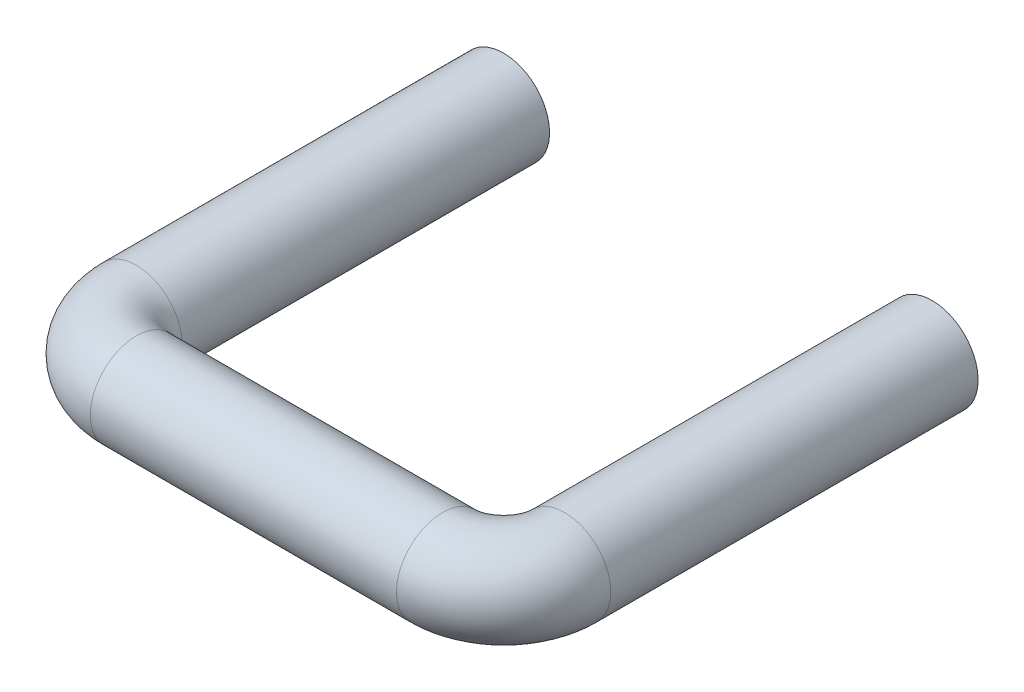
ISO-10303-21;
HEADER;
FILE_DESCRIPTION(('STEP AP214'),'2;1');
FILE_NAME('part.step','',(''),(''),'','','');
FILE_SCHEMA(('AUTOMOTIVE_DESIGN { 1 0 10303 214 1 1 1 1 }'));
ENDSEC;
DATA;
#1=APPLICATION_CONTEXT('core data for automotive mechanical design processes');
#2=APPLICATION_PROTOCOL_DEFINITION('international standard','automotive_design',2000,#1);
#3=PRODUCT_CONTEXT('',#1,'mechanical');
#4=PRODUCT('Part','Part','',(#3));
#5=PRODUCT_RELATED_PRODUCT_CATEGORY('part','',(#4));
#6=PRODUCT_DEFINITION_FORMATION('','',#4);
#7=PRODUCT_DEFINITION_CONTEXT('part definition',#1,'design');
#8=PRODUCT_DEFINITION('design','',#6,#7);
#9=PRODUCT_DEFINITION_SHAPE('','',#8);
#10=(LENGTH_UNIT() NAMED_UNIT(*) SI_UNIT(.MILLI.,.METRE.));
#11=(NAMED_UNIT(*) PLANE_ANGLE_UNIT() SI_UNIT($,.RADIAN.));
#12=(NAMED_UNIT(*) SI_UNIT($,.STERADIAN.) SOLID_ANGLE_UNIT());
#13=UNCERTAINTY_MEASURE_WITH_UNIT(LENGTH_MEASURE(1.E-05),#10,'distance_accuracy_value','');
#14=(GEOMETRIC_REPRESENTATION_CONTEXT(3) GLOBAL_UNCERTAINTY_ASSIGNED_CONTEXT((#13)) GLOBAL_UNIT_ASSIGNED_CONTEXT((#10,
#11,#12)) REPRESENTATION_CONTEXT('',''));
#15=CARTESIAN_POINT('',(0.,0.,0.));
#16=DIRECTION('',(0.,0.,1.));
#17=DIRECTION('',(1.,0.,0.));
#18=AXIS2_PLACEMENT_3D('',#15,#16,#17);
#19=CARTESIAN_POINT('',(70.,0.,60.));
#20=DIRECTION('',(0.,0.,-1.));
#21=DIRECTION('',(-1.,0.,0.));
#22=AXIS2_PLACEMENT_3D('',#19,#20,#21);
#23=CYLINDRICAL_SURFACE('',#22,7.5);
#24=CARTESIAN_POINT('',(70.,0.,60.));
#25=DIRECTION('',(0.,0.,-1.));
#26=DIRECTION('',(-1.,0.,0.));
#27=AXIS2_PLACEMENT_3D('',#24,#25,#26);
#28=CIRCLE('',#27,7.5);
#29=CARTESIAN_POINT('',(77.5,0.,60.));
#30=VERTEX_POINT('',#29);
#31=EDGE_CURVE('E37',#30,#30,#28,.T.);
#32=ORIENTED_EDGE('',*,*,#31,.T.);
#33=EDGE_LOOP('',(#32));
#34=FACE_BOUND('',#33,.T.);
#35=CARTESIAN_POINT('',(70.,0.,0.));
#36=DIRECTION('',(0.,0.,-1.));
#37=DIRECTION('',(-1.,0.,0.));
#38=AXIS2_PLACEMENT_3D('',#35,#36,#37);
#39=CIRCLE('',#38,7.5);
#40=CARTESIAN_POINT('',(62.5,0.,0.));
#41=VERTEX_POINT('',#40);
#42=EDGE_CURVE('E10',#41,#41,#39,.T.);
#43=ORIENTED_EDGE('',*,*,#42,.F.);
#44=EDGE_LOOP('',(#43));
#45=FACE_BOUND('',#44,.T.);
#46=ADVANCED_FACE('F31',(#34,#45),#23,.T.);
#47=CARTESIAN_POINT('',(60.,0.,60.));
#48=DIRECTION('',(0.,1.,0.));
#49=DIRECTION('',(0.,0.,1.));
#50=AXIS2_PLACEMENT_3D('',#47,#48,#49);
#51=TOROIDAL_SURFACE('',#50,10.,7.5);
#52=CARTESIAN_POINT('',(60.,0.,70.));
#53=DIRECTION('',(1.,0.,0.));
#54=DIRECTION('',(0.,0.,-1.));
#55=AXIS2_PLACEMENT_3D('',#52,#53,#54);
#56=CIRCLE('',#55,7.5);
#57=CARTESIAN_POINT('',(60.,0.,77.5));
#58=VERTEX_POINT('',#57);
#59=EDGE_CURVE('E41',#58,#58,#56,.T.);
#60=CARTESIAN_POINT('',(60.,0.,60.));
#61=DIRECTION('',(0.,1.,0.));
#62=DIRECTION('',(0.,0.,1.));
#63=AXIS2_PLACEMENT_3D('',#60,#61,#62);
#64=CIRCLE('',#63,17.5);
#65=EDGE_CURVE('',#58,#30,#64,.T.);
#66=ORIENTED_EDGE('',*,*,#59,.T.);
#67=ORIENTED_EDGE('',*,*,#31,.F.);
#68=ORIENTED_EDGE('',*,*,#65,.T.);
#69=ORIENTED_EDGE('',*,*,#65,.F.);
#70=EDGE_LOOP('',(#66,#68,#67,#69));
#71=FACE_BOUND('',#70,.T.);
#72=ADVANCED_FACE('F68',(#71),#51,.T.);
#73=CARTESIAN_POINT('',(10.,0.,70.));
#74=DIRECTION('',(1.,0.,0.));
#75=DIRECTION('',(0.,0.,-1.));
#76=AXIS2_PLACEMENT_3D('',#73,#74,#75);
#77=CYLINDRICAL_SURFACE('',#76,7.5);
#78=CARTESIAN_POINT('',(10.,0.,70.));
#79=DIRECTION('',(1.,0.,0.));
#80=DIRECTION('',(0.,0.,-1.));
#81=AXIS2_PLACEMENT_3D('',#78,#79,#80);
#82=CIRCLE('',#81,7.5);
#83=CARTESIAN_POINT('',(10.,0.,77.5));
#84=VERTEX_POINT('',#83);
#85=EDGE_CURVE('E45',#84,#84,#82,.T.);
#86=ORIENTED_EDGE('',*,*,#85,.T.);
#87=EDGE_LOOP('',(#86));
#88=FACE_BOUND('',#87,.T.);
#89=ORIENTED_EDGE('',*,*,#59,.F.);
#90=EDGE_LOOP('',(#89));
#91=FACE_BOUND('',#90,.T.);
#92=ADVANCED_FACE('F72',(#88,#91),#77,.T.);
#93=CARTESIAN_POINT('',(10.,0.,60.));
#94=DIRECTION('',(0.,1.,0.));
#95=DIRECTION('',(0.,0.,1.));
#96=AXIS2_PLACEMENT_3D('',#93,#94,#95);
#97=TOROIDAL_SURFACE('',#96,10.,7.5);
#98=CARTESIAN_POINT('',(0.,0.,60.));
#99=DIRECTION('',(0.,0.,1.));
#100=DIRECTION('',(1.,0.,0.));
#101=AXIS2_PLACEMENT_3D('',#98,#99,#100);
#102=CIRCLE('',#101,7.5);
#103=CARTESIAN_POINT('',(-7.49999999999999,0.,60.));
#104=VERTEX_POINT('',#103);
#105=EDGE_CURVE('E50',#104,#104,#102,.T.);
#106=CARTESIAN_POINT('',(10.,0.,60.));
#107=DIRECTION('',(0.,1.,0.));
#108=DIRECTION('',(0.,0.,1.));
#109=AXIS2_PLACEMENT_3D('',#106,#107,#108);
#110=CIRCLE('',#109,17.5);
#111=EDGE_CURVE('',#104,#84,#110,.T.);
#112=ORIENTED_EDGE('',*,*,#105,.T.);
#113=ORIENTED_EDGE('',*,*,#85,.F.);
#114=ORIENTED_EDGE('',*,*,#111,.T.);
#115=ORIENTED_EDGE('',*,*,#111,.F.);
#116=EDGE_LOOP('',(#112,#114,#113,#115));
#117=FACE_BOUND('',#116,.T.);
#118=ADVANCED_FACE('F78',(#117),#97,.T.);
#119=CARTESIAN_POINT('',(0.,0.,60.));
#120=DIRECTION('',(0.,0.,-1.));
#121=DIRECTION('',(-1.,0.,0.));
#122=AXIS2_PLACEMENT_3D('',#119,#120,#121);
#123=CYLINDRICAL_SURFACE('',#122,7.5);
#124=CARTESIAN_POINT('',(0.,0.,0.));
#125=DIRECTION('',(0.,0.,1.));
#126=DIRECTION('',(1.,0.,0.));
#127=AXIS2_PLACEMENT_3D('',#124,#125,#126);
#128=CIRCLE('',#127,7.5);
#129=CARTESIAN_POINT('',(-7.5,0.,0.));
#130=VERTEX_POINT('',#129);
#131=EDGE_CURVE('E53',#130,#130,#128,.T.);
#132=CARTESIAN_POINT('',(-7.49999999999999,0.,60.));
#133=CARTESIAN_POINT('',(-7.49999999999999,0.,59.375));
#134=CARTESIAN_POINT('',(-7.49999999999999,0.,58.75));
#135=CARTESIAN_POINT('',(-7.49999999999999,0.,57.5));
#136=CARTESIAN_POINT('',(-7.49999999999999,0.,56.875));
#137=CARTESIAN_POINT('',(-7.49999999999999,0.,55.625));
#138=CARTESIAN_POINT('',(-7.49999999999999,0.,55.));
#139=CARTESIAN_POINT('',(-7.49999999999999,0.,53.75));
#140=CARTESIAN_POINT('',(-7.49999999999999,0.,53.125));
#141=CARTESIAN_POINT('',(-7.49999999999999,0.,51.875));
#142=CARTESIAN_POINT('',(-7.49999999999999,0.,51.25));
#143=CARTESIAN_POINT('',(-7.49999999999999,0.,50.));
#144=CARTESIAN_POINT('',(-7.49999999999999,0.,49.375));
#145=CARTESIAN_POINT('',(-7.49999999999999,0.,48.125));
#146=CARTESIAN_POINT('',(-7.49999999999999,0.,47.5));
#147=CARTESIAN_POINT('',(-7.49999999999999,0.,46.25));
#148=CARTESIAN_POINT('',(-7.49999999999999,0.,45.625));
#149=CARTESIAN_POINT('',(-7.49999999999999,0.,44.375));
#150=CARTESIAN_POINT('',(-7.49999999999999,0.,43.75));
#151=CARTESIAN_POINT('',(-7.49999999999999,0.,42.5));
#152=CARTESIAN_POINT('',(-7.5,0.,41.875));
#153=CARTESIAN_POINT('',(-7.5,0.,40.625));
#154=CARTESIAN_POINT('',(-7.5,0.,40.));
#155=CARTESIAN_POINT('',(-7.5,0.,38.75));
#156=CARTESIAN_POINT('',(-7.5,0.,38.125));
#157=CARTESIAN_POINT('',(-7.5,0.,36.875));
#158=CARTESIAN_POINT('',(-7.5,0.,36.25));
#159=CARTESIAN_POINT('',(-7.5,0.,35.));
#160=CARTESIAN_POINT('',(-7.5,0.,34.375));
#161=CARTESIAN_POINT('',(-7.5,0.,33.125));
#162=CARTESIAN_POINT('',(-7.5,0.,32.5));
#163=CARTESIAN_POINT('',(-7.5,0.,31.25));
#164=CARTESIAN_POINT('',(-7.5,0.,30.625));
#165=CARTESIAN_POINT('',(-7.5,0.,29.375));
#166=CARTESIAN_POINT('',(-7.5,0.,28.75));
#167=CARTESIAN_POINT('',(-7.5,0.,27.5));
#168=CARTESIAN_POINT('',(-7.5,0.,26.875));
#169=CARTESIAN_POINT('',(-7.5,0.,25.625));
#170=CARTESIAN_POINT('',(-7.5,0.,25.));
#171=CARTESIAN_POINT('',(-7.5,0.,23.75));
#172=CARTESIAN_POINT('',(-7.5,0.,23.125));
#173=CARTESIAN_POINT('',(-7.5,0.,21.875));
#174=CARTESIAN_POINT('',(-7.5,0.,21.25));
#175=CARTESIAN_POINT('',(-7.5,0.,20.));
#176=CARTESIAN_POINT('',(-7.5,0.,19.375));
#177=CARTESIAN_POINT('',(-7.5,0.,18.125));
#178=CARTESIAN_POINT('',(-7.5,0.,17.5));
#179=CARTESIAN_POINT('',(-7.5,0.,16.25));
#180=CARTESIAN_POINT('',(-7.5,0.,15.625));
#181=CARTESIAN_POINT('',(-7.5,0.,14.375));
#182=CARTESIAN_POINT('',(-7.5,0.,13.75));
#183=CARTESIAN_POINT('',(-7.5,0.,12.5));
#184=CARTESIAN_POINT('',(-7.5,0.,11.875));
#185=CARTESIAN_POINT('',(-7.5,0.,10.625));
#186=CARTESIAN_POINT('',(-7.5,0.,10.));
#187=CARTESIAN_POINT('',(-7.5,0.,8.75));
#188=CARTESIAN_POINT('',(-7.5,0.,8.125));
#189=CARTESIAN_POINT('',(-7.5,0.,6.875));
#190=CARTESIAN_POINT('',(-7.5,0.,6.25));
#191=CARTESIAN_POINT('',(-7.5,0.,5.));
#192=CARTESIAN_POINT('',(-7.5,0.,4.375));
#193=CARTESIAN_POINT('',(-7.5,0.,3.125));
#194=CARTESIAN_POINT('',(-7.5,0.,2.5));
#195=CARTESIAN_POINT('',(-7.5,0.,1.25));
#196=CARTESIAN_POINT('',(-7.5,0.,0.625000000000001));
#197=CARTESIAN_POINT('',(-7.5,0.,0.));
#198=B_SPLINE_CURVE_WITH_KNOTS('',3,(#132,#133,#134,#135,#136,#137,#138,#139,#140,#141,#142,
#143,#144,#145,#146,#147,#148,#149,#150,#151,#152,#153,#154,#155,#156,#157,#158,#159,#160,#161,
#162,#163,#164,#165,#166,#167,#168,#169,#170,#171,#172,#173,#174,#175,#176,#177,#178,#179,#180,
#181,#182,#183,#184,#185,#186,#187,#188,#189,#190,#191,#192,#193,#194,#195,#196,#197),
.UNSPECIFIED.,.F.,.F.,(4,2,2,2,2,2,2,2,2,2,2,2,2,2,2,2,2,2,2,2,2,2,2,2,2,2,2,2,2,2,2,2,4),(0.,
1.87499999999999,3.75,5.625,7.49999999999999,9.37499999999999,11.25,13.125,15.,16.875,18.75,
20.625,22.5,24.375,26.25,28.125,30.,31.875,33.75,35.625,37.5,39.375,41.25,43.125,45.,46.875,
48.75,50.625,52.5,54.375,56.25,58.125,60.),.UNSPECIFIED.);
#199=EDGE_CURVE('BSEAM57',#104,#130,#198,.T.);
#200=ORIENTED_EDGE('',*,*,#105,.F.);
#201=ORIENTED_EDGE('',*,*,#131,.T.);
#202=ORIENTED_EDGE('',*,*,#199,.T.);
#203=ORIENTED_EDGE('',*,*,#199,.F.);
#204=EDGE_LOOP('',(#200,#202,#201,#203));
#205=FACE_BOUND('',#204,.T.);
#206=ADVANCED_FACE('F57',(#205),#123,.T.);
#207=CARTESIAN_POINT('',(70.,0.,0.));
#208=DIRECTION('',(0.,0.,-1.));
#209=DIRECTION('',(-1.,0.,0.));
#210=AXIS2_PLACEMENT_3D('',#207,#208,#209);
#211=PLANE('',#210);
#212=ORIENTED_EDGE('',*,*,#42,.T.);
#213=EDGE_LOOP('',(#212));
#214=FACE_BOUND('',#213,.T.);
#215=ADVANCED_FACE('F61',(#214),#211,.T.);
#216=CARTESIAN_POINT('',(0.,0.,0.));
#217=DIRECTION('',(0.,0.,1.));
#218=DIRECTION('',(1.,0.,0.));
#219=AXIS2_PLACEMENT_3D('',#216,#217,#218);
#220=PLANE('',#219);
#221=ORIENTED_EDGE('',*,*,#131,.F.);
#222=EDGE_LOOP('',(#221));
#223=FACE_BOUND('',#222,.T.);
#224=ADVANCED_FACE('F59',(#223),#220,.F.);
#225=CLOSED_SHELL('',(#46,#72,#92,#118,#206,#215,#224));
#226=MANIFOLD_SOLID_BREP('B2',#225);
#227=ADVANCED_BREP_SHAPE_REPRESENTATION('',(#18,#226),#14);
#228=SHAPE_DEFINITION_REPRESENTATION(#9,#227);
ENDSEC;
END-ISO-10303-21;
